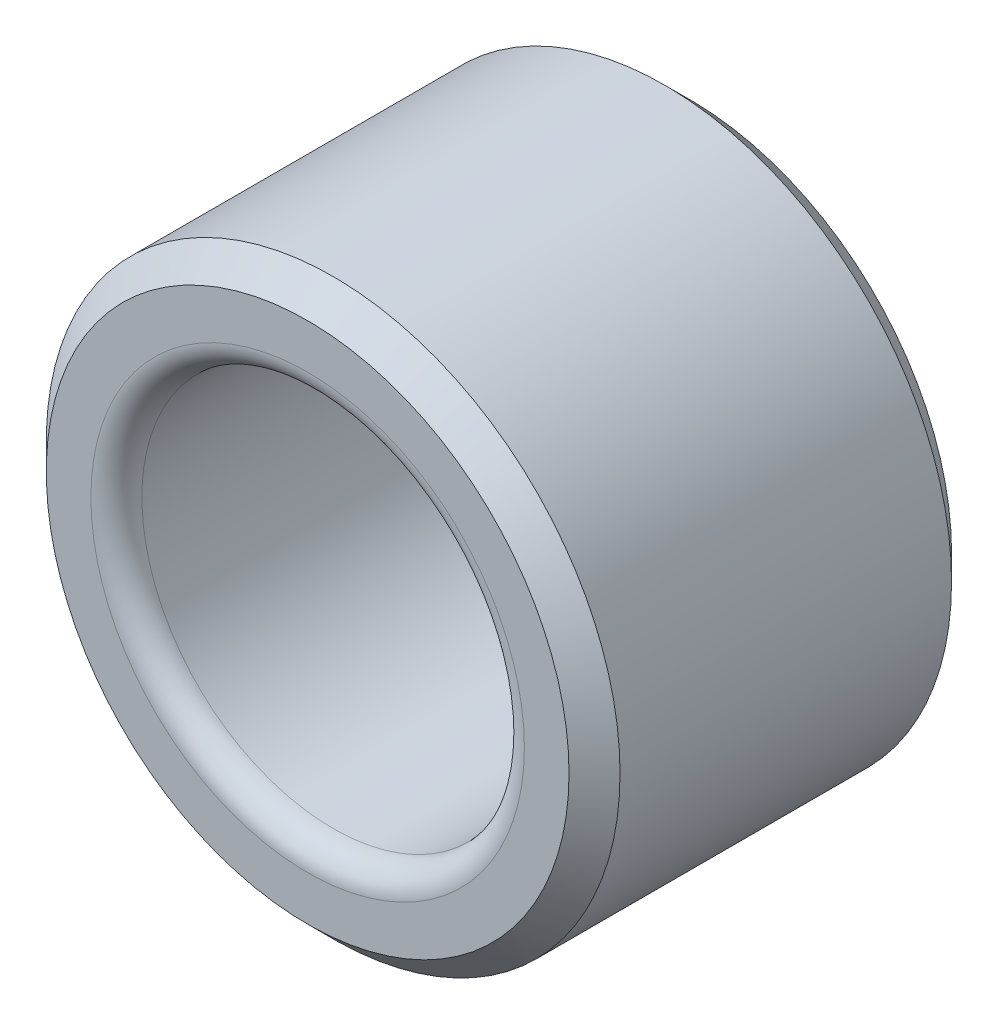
from build123d import *

# Parameters (mm, degrees)
SKETCH1_R      = 9
SKETCH1_R_2    = 6
EXTRUDE1_DEPTH = 12
CHAMFER1_SIZE  = 0.8
FILLET1_R      = 0.8


with BuildPart() as part:
    # Sketch1 → Extrude1 (new body)
    with BuildSketch(Plane.XY):
        Circle(SKETCH1_R)
        Circle(SKETCH1_R_2, mode=Mode.SUBTRACT)
    extrude(amount=EXTRUDE1_DEPTH)

    # Chamfer1
    chamfer1_edges = [part.edges().sort_by_distance(p)[0] for p in [
        (-9, 0, 0),
        (-9, 0, 12),
    ]]
    chamfer(chamfer1_edges, length=CHAMFER1_SIZE)

    # Fillet1
    fillet1_edges = [part.edges().sort_by_distance(p)[0] for p in [
        (-6, 0, 0),
        (-6, 0, 12),
    ]]
    fillet(fillet1_edges, radius=FILLET1_R)


solid = part.part
